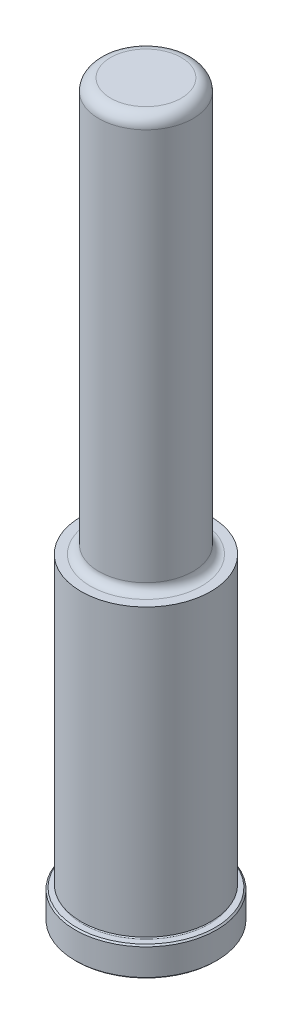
ISO-10303-21;
HEADER;
FILE_DESCRIPTION(('STEP AP214'),'2;1');
FILE_NAME('part.step','',(''),(''),'','','');
FILE_SCHEMA(('AUTOMOTIVE_DESIGN { 1 0 10303 214 1 1 1 1 }'));
ENDSEC;
DATA;
#1=APPLICATION_CONTEXT('core data for automotive mechanical design processes');
#2=APPLICATION_PROTOCOL_DEFINITION('international standard','automotive_design',2000,#1);
#3=PRODUCT_CONTEXT('',#1,'mechanical');
#4=PRODUCT('Part','Part','',(#3));
#5=PRODUCT_RELATED_PRODUCT_CATEGORY('part','',(#4));
#6=PRODUCT_DEFINITION_FORMATION('','',#4);
#7=PRODUCT_DEFINITION_CONTEXT('part definition',#1,'design');
#8=PRODUCT_DEFINITION('design','',#6,#7);
#9=PRODUCT_DEFINITION_SHAPE('','',#8);
#10=(LENGTH_UNIT() NAMED_UNIT(*) SI_UNIT(.MILLI.,.METRE.));
#11=(NAMED_UNIT(*) PLANE_ANGLE_UNIT() SI_UNIT($,.RADIAN.));
#12=(NAMED_UNIT(*) SI_UNIT($,.STERADIAN.) SOLID_ANGLE_UNIT());
#13=UNCERTAINTY_MEASURE_WITH_UNIT(LENGTH_MEASURE(1.E-05),#10,'distance_accuracy_value','');
#14=(GEOMETRIC_REPRESENTATION_CONTEXT(3) GLOBAL_UNCERTAINTY_ASSIGNED_CONTEXT((#13)) GLOBAL_UNIT_ASSIGNED_CONTEXT((#10,
#11,#12)) REPRESENTATION_CONTEXT('',''));
#15=CARTESIAN_POINT('',(0.,0.,0.));
#16=DIRECTION('',(0.,0.,1.));
#17=DIRECTION('',(1.,0.,0.));
#18=AXIS2_PLACEMENT_3D('',#15,#16,#17);
#19=CARTESIAN_POINT('',(0.,0.,0.));
#20=DIRECTION('',(0.,1.,0.));
#21=DIRECTION('',(0.,0.,1.));
#22=AXIS2_PLACEMENT_3D('',#19,#20,#21);
#23=PLANE('',#22);
#24=CARTESIAN_POINT('',(0.,0.,0.));
#25=DIRECTION('',(0.,1.,0.));
#26=DIRECTION('',(0.,0.,1.));
#27=AXIS2_PLACEMENT_3D('',#24,#25,#26);
#28=CIRCLE('',#27,18.669);
#29=CARTESIAN_POINT('',(0.,0.,18.669));
#30=VERTEX_POINT('',#29);
#31=EDGE_CURVE('E46',#30,#30,#28,.F.);
#32=ORIENTED_EDGE('',*,*,#31,.T.);
#33=EDGE_LOOP('',(#32));
#34=FACE_BOUND('',#33,.T.);
#35=ADVANCED_FACE('F31',(#34),#23,.F.);
#36=CARTESIAN_POINT('',(0.,0.,0.));
#37=DIRECTION('',(0.,1.,0.));
#38=DIRECTION('',(0.,0.,1.));
#39=AXIS2_PLACEMENT_3D('',#36,#37,#38);
#40=CYLINDRICAL_SURFACE('',#39,19.05);
#41=CARTESIAN_POINT('',(0.,0.380999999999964,0.));
#42=DIRECTION('',(0.,1.,0.));
#43=DIRECTION('',(0.,0.,1.));
#44=AXIS2_PLACEMENT_3D('',#41,#42,#43);
#45=CIRCLE('',#44,19.05);
#46=CARTESIAN_POINT('',(0.,0.380999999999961,19.05));
#47=VERTEX_POINT('',#46);
#48=EDGE_CURVE('E51',#47,#47,#45,.T.);
#49=ORIENTED_EDGE('',*,*,#48,.T.);
#50=EDGE_LOOP('',(#49));
#51=FACE_BOUND('',#50,.T.);
#52=CARTESIAN_POINT('',(0.,7.54379999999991,0.));
#53=DIRECTION('',(0.,-1.,0.));
#54=DIRECTION('',(0.,0.,-1.));
#55=AXIS2_PLACEMENT_3D('',#52,#53,#54);
#56=CIRCLE('',#55,19.05);
#57=CARTESIAN_POINT('',(0.,7.54379999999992,-19.05));
#58=VERTEX_POINT('',#57);
#59=EDGE_CURVE('E54',#58,#58,#56,.T.);
#60=ORIENTED_EDGE('',*,*,#59,.T.);
#61=EDGE_LOOP('',(#60));
#62=FACE_BOUND('',#61,.T.);
#63=ADVANCED_FACE('F110',(#51,#62),#40,.T.);
#64=CARTESIAN_POINT('',(0.,7.9248,-19.05));
#65=DIRECTION('',(0.,-1.,0.));
#66=DIRECTION('',(0.,0.,-1.));
#67=AXIS2_PLACEMENT_3D('',#64,#65,#66);
#68=PLANE('',#67);
#69=CARTESIAN_POINT('',(0.,7.9248,0.));
#70=DIRECTION('',(0.,-1.,0.));
#71=DIRECTION('',(0.,0.,-1.));
#72=AXIS2_PLACEMENT_3D('',#69,#70,#71);
#73=CIRCLE('',#72,18.6689999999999);
#74=CARTESIAN_POINT('',(0.,7.9248,-18.6689999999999));
#75=VERTEX_POINT('',#74);
#76=EDGE_CURVE('E42',#75,#75,#73,.F.);
#77=ORIENTED_EDGE('',*,*,#76,.T.);
#78=EDGE_LOOP('',(#77));
#79=FACE_BOUND('',#78,.T.);
#80=CARTESIAN_POINT('',(0.,7.9248,0.));
#81=DIRECTION('',(0.,1.,0.));
#82=DIRECTION('',(0.,0.,1.));
#83=AXIS2_PLACEMENT_3D('',#80,#81,#82);
#84=CIRCLE('',#83,17.0688);
#85=CARTESIAN_POINT('',(0.,7.92479999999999,17.0688));
#86=VERTEX_POINT('',#85);
#87=EDGE_CURVE('E57',#86,#86,#84,.T.);
#88=ORIENTED_EDGE('',*,*,#87,.F.);
#89=EDGE_LOOP('',(#88));
#90=FACE_BOUND('',#89,.T.);
#91=ADVANCED_FACE('F105',(#79,#90),#68,.F.);
#92=CARTESIAN_POINT('',(0.,8.3058,0.));
#93=DIRECTION('',(0.,1.,0.));
#94=DIRECTION('',(0.,0.,1.));
#95=AXIS2_PLACEMENT_3D('',#92,#93,#94);
#96=TOROIDAL_SURFACE('',#95,17.0688,0.381000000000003);
#97=CARTESIAN_POINT('',(0.,8.6868,0.));
#98=DIRECTION('',(0.,1.,0.));
#99=DIRECTION('',(0.,0.,1.));
#100=AXIS2_PLACEMENT_3D('',#97,#98,#99);
#101=CIRCLE('',#100,17.0688);
#102=CARTESIAN_POINT('',(0.,8.6868,17.0688));
#103=VERTEX_POINT('',#102);
#104=EDGE_CURVE('E60',#103,#103,#101,.T.);
#105=ORIENTED_EDGE('',*,*,#104,.F.);
#106=EDGE_LOOP('',(#105));
#107=FACE_BOUND('',#106,.T.);
#108=ORIENTED_EDGE('',*,*,#87,.T.);
#109=EDGE_LOOP('',(#108));
#110=FACE_BOUND('',#109,.T.);
#111=ADVANCED_FACE('F99',(#107,#110),#96,.F.);
#112=CARTESIAN_POINT('',(0.,8.6868,-17.0688));
#113=DIRECTION('',(0.,1.,0.));
#114=DIRECTION('',(0.,0.,1.));
#115=AXIS2_PLACEMENT_3D('',#112,#113,#114);
#116=PLANE('',#115);
#117=CARTESIAN_POINT('',(0.,8.6868,0.));
#118=DIRECTION('',(0.,1.,0.));
#119=DIRECTION('',(0.,0.,1.));
#120=AXIS2_PLACEMENT_3D('',#117,#118,#119);
#121=CIRCLE('',#120,17.4752);
#122=CARTESIAN_POINT('',(0.,8.6868,17.4752));
#123=VERTEX_POINT('',#122);
#124=EDGE_CURVE('E63',#123,#123,#121,.T.);
#125=ORIENTED_EDGE('',*,*,#124,.F.);
#126=EDGE_LOOP('',(#125));
#127=FACE_BOUND('',#126,.T.);
#128=ORIENTED_EDGE('',*,*,#104,.T.);
#129=EDGE_LOOP('',(#128));
#130=FACE_BOUND('',#129,.T.);
#131=ADVANCED_FACE('F93',(#127,#130),#116,.F.);
#132=CARTESIAN_POINT('',(0.,0.,0.));
#133=DIRECTION('',(0.,1.,0.));
#134=DIRECTION('',(0.,0.,1.));
#135=AXIS2_PLACEMENT_3D('',#132,#133,#134);
#136=CYLINDRICAL_SURFACE('',#135,17.4752);
#137=CARTESIAN_POINT('',(0.,85.725,0.));
#138=DIRECTION('',(0.,1.,0.));
#139=DIRECTION('',(0.,0.,1.));
#140=AXIS2_PLACEMENT_3D('',#137,#138,#139);
#141=CIRCLE('',#140,17.4752);
#142=CARTESIAN_POINT('',(0.,85.725,17.4752));
#143=VERTEX_POINT('',#142);
#144=EDGE_CURVE('E66',#143,#143,#141,.T.);
#145=ORIENTED_EDGE('',*,*,#144,.F.);
#146=EDGE_LOOP('',(#145));
#147=FACE_BOUND('',#146,.T.);
#148=ORIENTED_EDGE('',*,*,#124,.T.);
#149=EDGE_LOOP('',(#148));
#150=FACE_BOUND('',#149,.T.);
#151=ADVANCED_FACE('F87',(#147,#150),#136,.T.);
#152=CARTESIAN_POINT('',(0.,85.725,-17.4752));
#153=DIRECTION('',(0.,-1.,0.));
#154=DIRECTION('',(0.,0.,-1.));
#155=AXIS2_PLACEMENT_3D('',#152,#153,#154);
#156=PLANE('',#155);
#157=CARTESIAN_POINT('',(0.,85.725,0.));
#158=DIRECTION('',(0.,1.,0.));
#159=DIRECTION('',(0.,0.,1.));
#160=AXIS2_PLACEMENT_3D('',#157,#158,#159);
#161=CIRCLE('',#160,14.9733);
#162=CARTESIAN_POINT('',(0.,85.725,14.9733));
#163=VERTEX_POINT('',#162);
#164=EDGE_CURVE('E69',#163,#163,#161,.T.);
#165=ORIENTED_EDGE('',*,*,#164,.F.);
#166=EDGE_LOOP('',(#165));
#167=FACE_BOUND('',#166,.T.);
#168=ORIENTED_EDGE('',*,*,#144,.T.);
#169=EDGE_LOOP('',(#168));
#170=FACE_BOUND('',#169,.T.);
#171=ADVANCED_FACE('F81',(#167,#170),#156,.F.);
#172=CARTESIAN_POINT('',(0.,88.011,0.));
#173=DIRECTION('',(0.,1.,0.));
#174=DIRECTION('',(0.,0.,1.));
#175=AXIS2_PLACEMENT_3D('',#172,#173,#174);
#176=TOROIDAL_SURFACE('',#175,14.9733,2.286);
#177=CARTESIAN_POINT('',(0.,88.011,0.));
#178=DIRECTION('',(0.,1.,0.));
#179=DIRECTION('',(0.,0.,1.));
#180=AXIS2_PLACEMENT_3D('',#177,#178,#179);
#181=CIRCLE('',#180,12.6873);
#182=CARTESIAN_POINT('',(0.,88.011,12.6873));
#183=VERTEX_POINT('',#182);
#184=EDGE_CURVE('E72',#183,#183,#181,.T.);
#185=ORIENTED_EDGE('',*,*,#184,.F.);
#186=EDGE_LOOP('',(#185));
#187=FACE_BOUND('',#186,.T.);
#188=ORIENTED_EDGE('',*,*,#164,.T.);
#189=EDGE_LOOP('',(#188));
#190=FACE_BOUND('',#189,.T.);
#191=ADVANCED_FACE('F78',(#187,#190),#176,.F.);
#192=CARTESIAN_POINT('',(0.,0.,0.));
#193=DIRECTION('',(0.,1.,0.));
#194=DIRECTION('',(0.,0.,1.));
#195=AXIS2_PLACEMENT_3D('',#192,#193,#194);
#196=CYLINDRICAL_SURFACE('',#195,12.6873);
#197=CARTESIAN_POINT('',(0.,193.675,0.));
#198=DIRECTION('',(0.,-1.,0.));
#199=DIRECTION('',(0.,0.,-1.));
#200=AXIS2_PLACEMENT_3D('',#197,#198,#199);
#201=CIRCLE('',#200,12.6873);
#202=CARTESIAN_POINT('',(0.,193.675,-12.6873));
#203=VERTEX_POINT('',#202);
#204=EDGE_CURVE('E10',#203,#203,#201,.T.);
#205=ORIENTED_EDGE('',*,*,#204,.T.);
#206=EDGE_LOOP('',(#205));
#207=FACE_BOUND('',#206,.T.);
#208=ORIENTED_EDGE('',*,*,#184,.T.);
#209=EDGE_LOOP('',(#208));
#210=FACE_BOUND('',#209,.T.);
#211=ADVANCED_FACE('F76',(#207,#210),#196,.T.);
#212=CARTESIAN_POINT('',(0.,196.85,-12.6873));
#213=DIRECTION('',(0.,-1.,0.));
#214=DIRECTION('',(0.,0.,-1.));
#215=AXIS2_PLACEMENT_3D('',#212,#213,#214);
#216=PLANE('',#215);
#217=CARTESIAN_POINT('',(0.,196.85,0.));
#218=DIRECTION('',(0.,-1.,0.));
#219=DIRECTION('',(0.,0.,-1.));
#220=AXIS2_PLACEMENT_3D('',#217,#218,#219);
#221=CIRCLE('',#220,9.51230000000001);
#222=CARTESIAN_POINT('',(0.,196.85,-9.51229999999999));
#223=VERTEX_POINT('',#222);
#224=EDGE_CURVE('E38',#223,#223,#221,.F.);
#225=ORIENTED_EDGE('',*,*,#224,.T.);
#226=EDGE_LOOP('',(#225));
#227=FACE_BOUND('',#226,.T.);
#228=ADVANCED_FACE('F127',(#227),#216,.F.);
#229=CARTESIAN_POINT('',(0.,0.380999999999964,0.));
#230=DIRECTION('',(0.,1.,0.));
#231=DIRECTION('',(0.,0.,1.));
#232=AXIS2_PLACEMENT_3D('',#229,#230,#231);
#233=CONICAL_SURFACE('',#232,19.05,0.785398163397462);
#234=ORIENTED_EDGE('',*,*,#31,.F.);
#235=EDGE_LOOP('',(#234));
#236=FACE_BOUND('',#235,.T.);
#237=ORIENTED_EDGE('',*,*,#48,.F.);
#238=EDGE_LOOP('',(#237));
#239=FACE_BOUND('',#238,.T.);
#240=ADVANCED_FACE('F124',(#236,#239),#233,.T.);
#241=CARTESIAN_POINT('',(0.,7.9248,0.));
#242=DIRECTION('',(0.,-1.,0.));
#243=DIRECTION('',(0.,0.,-1.));
#244=AXIS2_PLACEMENT_3D('',#241,#242,#243);
#245=CONICAL_SURFACE('',#244,18.6689999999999,0.785398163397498);
#246=ORIENTED_EDGE('',*,*,#59,.F.);
#247=EDGE_LOOP('',(#246));
#248=FACE_BOUND('',#247,.T.);
#249=ORIENTED_EDGE('',*,*,#76,.F.);
#250=EDGE_LOOP('',(#249));
#251=FACE_BOUND('',#250,.T.);
#252=ADVANCED_FACE('F126',(#248,#251),#245,.T.);
#253=CARTESIAN_POINT('',(0.,193.675,0.));
#254=DIRECTION('',(0.,-1.,0.));
#255=DIRECTION('',(0.,0.,-1.));
#256=AXIS2_PLACEMENT_3D('',#253,#254,#255);
#257=TOROIDAL_SURFACE('',#256,9.51230000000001,3.175);
#258=ORIENTED_EDGE('',*,*,#204,.F.);
#259=EDGE_LOOP('',(#258));
#260=FACE_BOUND('',#259,.T.);
#261=ORIENTED_EDGE('',*,*,#224,.F.);
#262=EDGE_LOOP('',(#261));
#263=FACE_BOUND('',#262,.T.);
#264=ADVANCED_FACE('F33',(#260,#263),#257,.T.);
#265=CLOSED_SHELL('',(#35,#63,#91,#111,#131,#151,#171,#191,#211,#228,#240,#252,#264));
#266=MANIFOLD_SOLID_BREP('B2',#265);
#267=ADVANCED_BREP_SHAPE_REPRESENTATION('',(#18,#266),#14);
#268=SHAPE_DEFINITION_REPRESENTATION(#9,#267);
ENDSEC;
END-ISO-10303-21;
